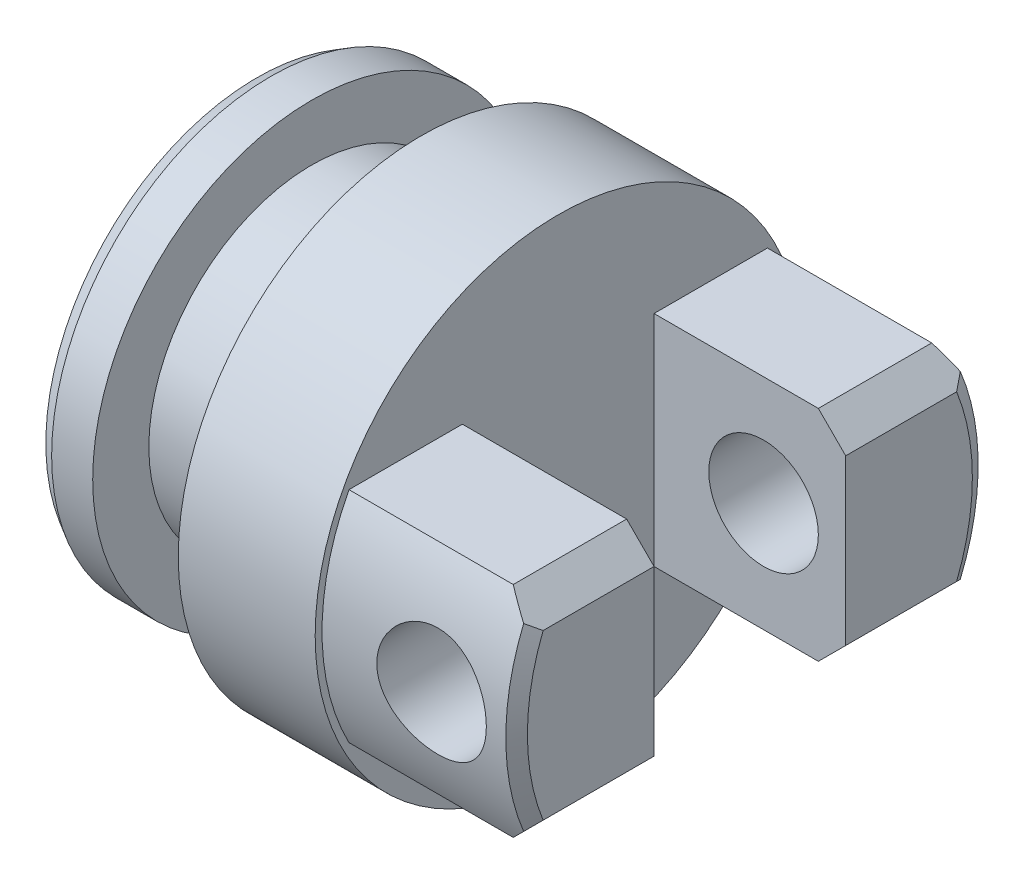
ISO-10303-21;
HEADER;
FILE_DESCRIPTION(('STEP AP214'),'2;1');
FILE_NAME('part.step','',(''),(''),'','','');
FILE_SCHEMA(('AUTOMOTIVE_DESIGN { 1 0 10303 214 1 1 1 1 }'));
ENDSEC;
DATA;
#1=APPLICATION_CONTEXT('core data for automotive mechanical design processes');
#2=APPLICATION_PROTOCOL_DEFINITION('international standard','automotive_design',2000,#1);
#3=PRODUCT_CONTEXT('',#1,'mechanical');
#4=PRODUCT('Part','Part','',(#3));
#5=PRODUCT_RELATED_PRODUCT_CATEGORY('part','',(#4));
#6=PRODUCT_DEFINITION_FORMATION('','',#4);
#7=PRODUCT_DEFINITION_CONTEXT('part definition',#1,'design');
#8=PRODUCT_DEFINITION('design','',#6,#7);
#9=PRODUCT_DEFINITION_SHAPE('','',#8);
#10=(LENGTH_UNIT() NAMED_UNIT(*) SI_UNIT(.MILLI.,.METRE.));
#11=(NAMED_UNIT(*) PLANE_ANGLE_UNIT() SI_UNIT($,.RADIAN.));
#12=(NAMED_UNIT(*) SI_UNIT($,.STERADIAN.) SOLID_ANGLE_UNIT());
#13=UNCERTAINTY_MEASURE_WITH_UNIT(LENGTH_MEASURE(1.E-05),#10,'distance_accuracy_value','');
#14=(GEOMETRIC_REPRESENTATION_CONTEXT(3) GLOBAL_UNCERTAINTY_ASSIGNED_CONTEXT((#13)) GLOBAL_UNIT_ASSIGNED_CONTEXT((#10,
#11,#12)) REPRESENTATION_CONTEXT('',''));
#15=CARTESIAN_POINT('',(0.,0.,0.));
#16=DIRECTION('',(0.,0.,1.));
#17=DIRECTION('',(1.,0.,0.));
#18=AXIS2_PLACEMENT_3D('',#15,#16,#17);
#19=CARTESIAN_POINT('',(0.,0.,0.));
#20=DIRECTION('',(-1.,0.,0.));
#21=DIRECTION('',(0.,0.,1.));
#22=AXIS2_PLACEMENT_3D('',#19,#20,#21);
#23=PLANE('',#22);
#24=DIRECTION('',(0.,-1.,0.));
#25=VECTOR('',#24,1.);
#26=CARTESIAN_POINT('',(0.,20.,7.));
#27=LINE('',#26,#25);
#28=CARTESIAN_POINT('',(0.,5.99999999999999,7.));
#29=VERTEX_POINT('',#28);
#30=CARTESIAN_POINT('',(0.,-5.99999999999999,7.));
#31=VERTEX_POINT('',#30);
#32=EDGE_CURVE('E319',#29,#31,#27,.T.);
#33=ORIENTED_EDGE('',*,*,#32,.F.);
#34=DIRECTION('',(0.,0.,1.));
#35=VECTOR('',#34,1.);
#36=CARTESIAN_POINT('',(0.,5.99999999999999,0.));
#37=LINE('',#36,#35);
#38=CARTESIAN_POINT('',(0.,5.99999999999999,15.101738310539));
#39=VERTEX_POINT('',#38);
#40=EDGE_CURVE('E191',#29,#39,#37,.T.);
#41=ORIENTED_EDGE('',*,*,#40,.T.);
#42=CARTESIAN_POINT('',(0.,0.,0.));
#43=DIRECTION('',(-1.,0.,0.));
#44=DIRECTION('',(0.,0.,1.));
#45=AXIS2_PLACEMENT_3D('',#42,#43,#44);
#46=CIRCLE('',#45,16.25);
#47=CARTESIAN_POINT('',(0.,-5.99999999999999,15.101738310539));
#48=VERTEX_POINT('',#47);
#49=EDGE_CURVE('E171',#39,#48,#46,.F.);
#50=ORIENTED_EDGE('',*,*,#49,.T.);
#51=DIRECTION('',(0.,0.,-1.));
#52=VECTOR('',#51,1.);
#53=CARTESIAN_POINT('',(0.,-5.99999999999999,0.));
#54=LINE('',#53,#52);
#55=EDGE_CURVE('E189',#48,#31,#54,.T.);
#56=ORIENTED_EDGE('',*,*,#55,.T.);
#57=EDGE_LOOP('',(#33,#41,#50,#56));
#58=FACE_BOUND('',#57,.T.);
#59=ADVANCED_FACE('F24',(#58),#23,.F.);
#60=CARTESIAN_POINT('',(-110.,0.,0.));
#61=DIRECTION('',(-1.,0.,0.));
#62=DIRECTION('',(0.,0.,1.));
#63=AXIS2_PLACEMENT_3D('',#60,#61,#62);
#64=CYLINDRICAL_SURFACE('',#63,17.25);
#65=CARTESIAN_POINT('',(-1.99999999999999,0.,17.25));
#66=CARTESIAN_POINT('',(-2.00000706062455,0.221506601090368,17.2499959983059));
#67=CARTESIAN_POINT('',(-2.01846148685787,0.44309577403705,17.2456904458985));
#68=CARTESIAN_POINT('',(-2.09170127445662,0.879956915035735,17.2289311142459));
#69=CARTESIAN_POINT('',(-2.14651041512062,1.0952246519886,17.2164720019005));
#70=CARTESIAN_POINT('',(-2.29063244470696,1.51306826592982,17.1847897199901));
#71=CARTESIAN_POINT('',(-2.37990708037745,1.71565792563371,17.1655740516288));
#72=CARTESIAN_POINT('',(-2.59029904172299,2.10298031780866,17.1224413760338));
#73=CARTESIAN_POINT('',(-2.71141632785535,2.28771307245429,17.0985243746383));
#74=CARTESIAN_POINT('',(-2.98434860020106,2.63738921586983,17.0481208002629));
#75=CARTESIAN_POINT('',(-3.13662529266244,2.80196719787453,17.0215991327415));
#76=CARTESIAN_POINT('',(-3.46656368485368,3.1034905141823,16.9692168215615));
#77=CARTESIAN_POINT('',(-3.64422787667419,3.24043313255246,16.9433562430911));
#78=CARTESIAN_POINT('',(-4.02265469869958,3.48445355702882,16.8948751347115));
#79=CARTESIAN_POINT('',(-4.22367958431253,3.59113436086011,16.8722994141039));
#80=CARTESIAN_POINT('',(-4.64141512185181,3.76905373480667,16.8334513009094));
#81=CARTESIAN_POINT('',(-4.85812364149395,3.84029711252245,16.817178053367));
#82=CARTESIAN_POINT('',(-5.2970883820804,3.94409580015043,16.7931362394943));
#83=CARTESIAN_POINT('',(-5.5191826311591,3.97730224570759,16.7852247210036));
#84=CARTESIAN_POINT('',(-5.96591974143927,4.00611058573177,16.7783734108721));
#85=CARTESIAN_POINT('',(-6.19056224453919,4.00171770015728,16.7794323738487));
#86=CARTESIAN_POINT('',(-6.63111872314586,3.95597424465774,16.790273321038));
#87=CARTESIAN_POINT('',(-6.84711716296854,3.91538784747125,16.7998749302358));
#88=CARTESIAN_POINT('',(-7.26915302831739,3.79962352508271,16.8264332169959));
#89=CARTESIAN_POINT('',(-7.47518983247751,3.72444344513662,16.8433903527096));
#90=CARTESIAN_POINT('',(-7.87356168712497,3.54094485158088,16.8829218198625));
#91=CARTESIAN_POINT('',(-8.0657594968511,3.43233923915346,16.9055444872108));
#92=CARTESIAN_POINT('',(-8.4294820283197,3.18527389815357,16.9538293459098));
#93=CARTESIAN_POINT('',(-8.6010035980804,3.04680962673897,16.979491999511));
#94=CARTESIAN_POINT('',(-8.92289638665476,2.73994743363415,17.0317334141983));
#95=CARTESIAN_POINT('',(-9.07264952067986,2.57090164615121,17.0583192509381));
#96=CARTESIAN_POINT('',(-9.34178879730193,2.20978670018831,17.108843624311));
#97=CARTESIAN_POINT('',(-9.46117424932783,2.01771701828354,17.1327821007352));
#98=CARTESIAN_POINT('',(-9.66637164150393,1.61520052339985,17.1754080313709));
#99=CARTESIAN_POINT('',(-9.75209475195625,1.40470685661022,17.1940815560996));
#100=CARTESIAN_POINT('',(-9.8867764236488,0.971771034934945,17.2239711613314));
#101=CARTESIAN_POINT('',(-9.93574101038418,0.749330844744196,17.2351884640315));
#102=CARTESIAN_POINT('',(-9.99459855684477,0.304110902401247,17.2487249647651));
#103=CARTESIAN_POINT('',(-10.0053347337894,0.0814483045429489,17.2512361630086));
#104=CARTESIAN_POINT('',(-9.9897272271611,-0.362489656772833,17.2476191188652));
#105=CARTESIAN_POINT('',(-9.9633863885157,-0.583765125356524,17.2414915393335));
#106=CARTESIAN_POINT('',(-9.87507032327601,-1.01579848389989,17.221407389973));
#107=CARTESIAN_POINT('',(-9.81354457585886,-1.22665326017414,17.2075496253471));
#108=CARTESIAN_POINT('',(-9.65710994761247,-1.6350457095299,17.1735597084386));
#109=CARTESIAN_POINT('',(-9.56219799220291,-1.83258215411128,17.1534269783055));
#110=CARTESIAN_POINT('',(-9.33997837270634,-2.21216422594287,17.1086517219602));
#111=CARTESIAN_POINT('',(-9.21218467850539,-2.39391735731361,17.0839432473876));
#112=CARTESIAN_POINT('',(-8.92846140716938,-2.73370057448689,17.0328786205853));
#113=CARTESIAN_POINT('',(-8.77252769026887,-2.89172716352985,17.0065222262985));
#114=CARTESIAN_POINT('',(-8.43306118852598,-3.18296339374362,16.9544575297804));
#115=CARTESIAN_POINT('',(-8.24902001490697,-3.31558580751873,16.9287742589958));
#116=CARTESIAN_POINT('',(-7.86078631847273,-3.54804966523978,16.8815866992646));
#117=CARTESIAN_POINT('',(-7.65659469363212,-3.64789256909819,16.860082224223));
#118=CARTESIAN_POINT('',(-7.23497071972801,-3.8112529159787,16.8239072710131));
#119=CARTESIAN_POINT('',(-7.01762394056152,-3.87498197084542,16.809197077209));
#120=CARTESIAN_POINT('',(-6.57491612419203,-3.96490426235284,16.788216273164));
#121=CARTESIAN_POINT('',(-6.34955656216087,-3.99110437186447,16.7819441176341));
#122=CARTESIAN_POINT('',(-5.90316218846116,-4.00490486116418,16.7786553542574));
#123=CARTESIAN_POINT('',(-5.68215739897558,-3.99343911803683,16.7814148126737));
#124=CARTESIAN_POINT('',(-5.24532276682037,-3.93434122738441,16.7953673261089));
#125=CARTESIAN_POINT('',(-5.02949284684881,-3.88670962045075,16.8065602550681));
#126=CARTESIAN_POINT('',(-4.60998733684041,-3.75710794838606,16.8360028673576));
#127=CARTESIAN_POINT('',(-4.40626248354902,-3.67528976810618,16.8542213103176));
#128=CARTESIAN_POINT('',(-4.01529825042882,-3.47976246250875,16.8956709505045));
#129=CARTESIAN_POINT('',(-3.82806083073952,-3.36604955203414,16.9189027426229));
#130=CARTESIAN_POINT('',(-3.47081908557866,-3.1069323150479,16.9684180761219));
#131=CARTESIAN_POINT('',(-3.30130026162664,-2.96086942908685,16.9947587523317));
#132=CARTESIAN_POINT('',(-2.98887408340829,-2.64251267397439,17.0471581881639));
#133=CARTESIAN_POINT('',(-2.84597294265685,-2.47021269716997,17.0732168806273));
#134=CARTESIAN_POINT('',(-2.58877209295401,-2.10115892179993,17.122580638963));
#135=CARTESIAN_POINT('',(-2.47493294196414,-1.90407744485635,17.1458386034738));
#136=CARTESIAN_POINT('',(-2.28218053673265,-1.49306767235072,17.1864989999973));
#137=CARTESIAN_POINT('',(-2.20323969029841,-1.27915284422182,17.2039060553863));
#138=CARTESIAN_POINT('',(-2.0956527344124,-0.88770869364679,17.2280104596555));
#139=CARTESIAN_POINT('',(-2.05985497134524,-0.712201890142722,17.236203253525));
#140=CARTESIAN_POINT('',(-2.01202641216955,-0.357814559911,17.2471994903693));
#141=CARTESIAN_POINT('',(-1.99999429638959,-0.178934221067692,17.25000323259));
#142=CARTESIAN_POINT('',(-1.99999999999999,0.,17.25));
#143=B_SPLINE_CURVE_WITH_KNOTS('',3,(#65,#66,#67,#68,#69,#70,#71,#72,#73,#74,#75,#76,#77,#78,
#79,#80,#81,#82,#83,#84,#85,#86,#87,#88,#89,#90,#91,#92,#93,#94,#95,#96,#97,#98,#99,#100,#101,
#102,#103,#104,#105,#106,#107,#108,#109,#110,#111,#112,#113,#114,#115,#116,#117,#118,#119,#120,
#121,#122,#123,#124,#125,#126,#127,#128,#129,#130,#131,#132,#133,#134,#135,#136,#137,#138,#139,
#140,#141,#142),.UNSPECIFIED.,.T.,.F.,(4,2,2,2,2,2,2,2,2,2,2,2,2,2,2,2,2,2,2,2,2,2,2,2,2,2,2,2,
2,2,2,2,2,2,2,2,2,2,4),(0.,0.663864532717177,1.3281637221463,1.99172771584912,2.65529088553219,
3.32950939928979,4.00379414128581,4.68655391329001,5.36922103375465,6.04001855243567,
6.71072294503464,7.36759312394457,8.02450422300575,8.68722303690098,9.35004275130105,
10.0290330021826,10.7080386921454,11.3888243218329,12.0694983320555,12.7350621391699,
13.4005748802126,14.0577699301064,14.7150255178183,15.3826181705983,16.0503091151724,
16.7319447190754,17.4135499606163,18.0911188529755,18.768563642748,19.4293400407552,
20.090106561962,20.7479681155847,21.4059077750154,22.0787271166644,22.7517033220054,
23.4347615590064,24.1172787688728,24.6535818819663,25.1898552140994),.UNSPECIFIED.);
#144=CARTESIAN_POINT('',(-1.99999999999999,0.,17.25));
#145=VERTEX_POINT('',#144);
#146=EDGE_CURVE('E346',#145,#145,#143,.T.);
#147=ORIENTED_EDGE('',*,*,#146,.F.);
#148=EDGE_LOOP('',(#147));
#149=FACE_BOUND('',#148,.T.);
#150=CARTESIAN_POINT('',(-0.577350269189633,0.,0.));
#151=DIRECTION('',(-1.,0.,0.));
#152=DIRECTION('',(0.,0.,1.));
#153=AXIS2_PLACEMENT_3D('',#150,#151,#152);
#154=CIRCLE('',#153,17.25);
#155=CARTESIAN_POINT('',(-0.577350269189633,-6.57735026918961,15.9468167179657));
#156=VERTEX_POINT('',#155);
#157=CARTESIAN_POINT('',(-0.577350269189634,6.57735026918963,15.9468167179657));
#158=VERTEX_POINT('',#157);
#159=EDGE_CURVE('E168',#156,#158,#154,.T.);
#160=ORIENTED_EDGE('',*,*,#159,.T.);
#161=CARTESIAN_POINT('',(6.00000000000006,0.,0.));
#162=DIRECTION('',(-0.707106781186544,-0.707106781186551,0.));
#163=DIRECTION('',(-0.707106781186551,0.707106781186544,0.));
#164=AXIS2_PLACEMENT_3D('',#161,#162,#163);
#165=ELLIPSE('',#164,24.395183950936,17.25);
#166=CARTESIAN_POINT('',(-2.00000000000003,8.,15.2827517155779));
#167=VERTEX_POINT('',#166);
#168=EDGE_CURVE('E536',#158,#167,#165,.T.);
#169=ORIENTED_EDGE('',*,*,#168,.T.);
#170=DIRECTION('',(-1.,0.,0.));
#171=VECTOR('',#170,1.);
#172=CARTESIAN_POINT('',(-110.,8.,15.2827517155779));
#173=LINE('',#172,#171);
#174=CARTESIAN_POINT('',(-14.,8.,15.2827517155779));
#175=VERTEX_POINT('',#174);
#176=EDGE_CURVE('E316',#175,#167,#173,.F.);
#177=ORIENTED_EDGE('',*,*,#176,.F.);
#178=CARTESIAN_POINT('',(-14.,0.,0.));
#179=DIRECTION('',(-1.,0.,0.));
#180=DIRECTION('',(0.,0.,1.));
#181=AXIS2_PLACEMENT_3D('',#178,#179,#180);
#182=CIRCLE('',#181,17.25);
#183=CARTESIAN_POINT('',(-14.,-8.,15.2827517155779));
#184=VERTEX_POINT('',#183);
#185=EDGE_CURVE('E157',#184,#175,#182,.T.);
#186=ORIENTED_EDGE('',*,*,#185,.F.);
#187=DIRECTION('',(-1.,0.,0.));
#188=VECTOR('',#187,1.);
#189=CARTESIAN_POINT('',(-110.,-8.,15.2827517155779));
#190=LINE('',#189,#188);
#191=CARTESIAN_POINT('',(-2.00000000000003,-8.,15.2827517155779));
#192=VERTEX_POINT('',#191);
#193=EDGE_CURVE('E149',#192,#184,#190,.T.);
#194=ORIENTED_EDGE('',*,*,#193,.F.);
#195=CARTESIAN_POINT('',(6.00000000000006,0.,0.));
#196=DIRECTION('',(-0.707106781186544,0.707106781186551,0.));
#197=DIRECTION('',(-0.707106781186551,-0.707106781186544,0.));
#198=AXIS2_PLACEMENT_3D('',#195,#196,#197);
#199=ELLIPSE('',#198,24.395183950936,17.25);
#200=EDGE_CURVE('E329',#192,#156,#199,.T.);
#201=ORIENTED_EDGE('',*,*,#200,.T.);
#202=EDGE_LOOP('',(#160,#169,#177,#186,#194,#201));
#203=FACE_BOUND('',#202,.T.);
#204=ADVANCED_FACE('F281',(#149,#203),#64,.T.);
#205=CARTESIAN_POINT('',(-0.577350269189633,0.,0.));
#206=DIRECTION('',(-1.,0.,0.));
#207=DIRECTION('',(0.,0.,1.));
#208=AXIS2_PLACEMENT_3D('',#205,#206,#207);
#209=CONICAL_SURFACE('',#208,17.25,1.04719755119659);
#210=ORIENTED_EDGE('',*,*,#49,.F.);
#211=CARTESIAN_POINT('',(0.,5.99999999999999,15.101738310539));
#212=CARTESIAN_POINT('',(-0.0961349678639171,6.0961349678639,15.2427077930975));
#213=CARTESIAN_POINT('',(-0.192314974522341,6.19231497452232,15.3836157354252));
#214=CARTESIAN_POINT('',(-0.384765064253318,6.3847650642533,15.6653085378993));
#215=CARTESIAN_POINT('',(-0.481035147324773,6.48103514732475,15.8060933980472));
#216=CARTESIAN_POINT('',(-0.577350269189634,6.57735026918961,15.9468167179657));
#217=B_SPLINE_CURVE_WITH_KNOTS('',3,(#211,#212,#213,#214,#215,#216),.UNSPECIFIED.,.F.,.F.,(4,2,
4),(0.,0.587542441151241,1.17508487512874),.UNSPECIFIED.);
#218=EDGE_CURVE('E200',#39,#158,#217,.T.);
#219=ORIENTED_EDGE('',*,*,#218,.T.);
#220=ORIENTED_EDGE('',*,*,#159,.F.);
#221=CARTESIAN_POINT('',(-0.577350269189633,-6.57735026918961,15.9468167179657));
#222=CARTESIAN_POINT('',(-0.481035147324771,-6.48103514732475,15.8060933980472));
#223=CARTESIAN_POINT('',(-0.384765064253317,-6.3847650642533,15.6653085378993));
#224=CARTESIAN_POINT('',(-0.192314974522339,-6.19231497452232,15.3836157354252));
#225=CARTESIAN_POINT('',(-0.0961349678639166,-6.0961349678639,15.2427077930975));
#226=CARTESIAN_POINT('',(0.,-5.99999999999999,15.101738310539));
#227=B_SPLINE_CURVE_WITH_KNOTS('',3,(#221,#222,#223,#224,#225,#226),.UNSPECIFIED.,.F.,.F.,(4,2,
4),(0.,0.587542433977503,1.17508487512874),.UNSPECIFIED.);
#228=EDGE_CURVE('E193',#156,#48,#227,.T.);
#229=ORIENTED_EDGE('',*,*,#228,.T.);
#230=EDGE_LOOP('',(#210,#219,#220,#229));
#231=FACE_BOUND('',#230,.T.);
#232=ADVANCED_FACE('F288',(#231),#209,.T.);
#233=CARTESIAN_POINT('',(0.,-5.99999999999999,-15.101738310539));
#234=VERTEX_POINT('',#233);
#235=CARTESIAN_POINT('',(0.,5.99999999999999,-15.101738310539));
#236=VERTEX_POINT('',#235);
#237=EDGE_CURVE('E172',#234,#236,#46,.F.);
#238=ORIENTED_EDGE('',*,*,#237,.T.);
#239=DIRECTION('',(0.,0.,1.));
#240=VECTOR('',#239,1.);
#241=CARTESIAN_POINT('',(0.,5.99999999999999,0.));
#242=LINE('',#241,#240);
#243=CARTESIAN_POINT('',(0.,5.99999999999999,-7.));
#244=VERTEX_POINT('',#243);
#245=EDGE_CURVE('E47',#236,#244,#242,.T.);
#246=ORIENTED_EDGE('',*,*,#245,.T.);
#247=DIRECTION('',(0.,1.,0.));
#248=VECTOR('',#247,1.);
#249=CARTESIAN_POINT('',(0.,-20.,-7.));
#250=LINE('',#249,#248);
#251=CARTESIAN_POINT('',(0.,-5.99999999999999,-7.));
#252=VERTEX_POINT('',#251);
#253=EDGE_CURVE('E254',#252,#244,#250,.T.);
#254=ORIENTED_EDGE('',*,*,#253,.F.);
#255=DIRECTION('',(0.,0.,-1.));
#256=VECTOR('',#255,1.);
#257=CARTESIAN_POINT('',(0.,-5.99999999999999,0.));
#258=LINE('',#257,#256);
#259=EDGE_CURVE('E238',#252,#234,#258,.T.);
#260=ORIENTED_EDGE('',*,*,#259,.T.);
#261=EDGE_LOOP('',(#238,#246,#254,#260));
#262=FACE_BOUND('',#261,.T.);
#263=ADVANCED_FACE('F26',(#262),#23,.F.);
#264=CARTESIAN_POINT('',(-2.,0.,-17.25));
#265=CARTESIAN_POINT('',(-2.00000706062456,-0.221506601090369,-17.2499959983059));
#266=CARTESIAN_POINT('',(-2.01846148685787,-0.44309577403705,-17.2456904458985));
#267=CARTESIAN_POINT('',(-2.09170127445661,-0.879956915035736,-17.2289311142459));
#268=CARTESIAN_POINT('',(-2.14651041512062,-1.0952246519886,-17.2164720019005));
#269=CARTESIAN_POINT('',(-2.29063244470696,-1.51306826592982,-17.1847897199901));
#270=CARTESIAN_POINT('',(-2.37990708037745,-1.71565792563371,-17.1655740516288));
#271=CARTESIAN_POINT('',(-2.59029904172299,-2.10298031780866,-17.1224413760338));
#272=CARTESIAN_POINT('',(-2.71141632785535,-2.28771307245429,-17.0985243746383));
#273=CARTESIAN_POINT('',(-2.98434860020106,-2.63738921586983,-17.0481208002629));
#274=CARTESIAN_POINT('',(-3.13662529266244,-2.80196719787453,-17.0215991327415));
#275=CARTESIAN_POINT('',(-3.46656368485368,-3.1034905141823,-16.9692168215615));
#276=CARTESIAN_POINT('',(-3.64422787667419,-3.24043313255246,-16.9433562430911));
#277=CARTESIAN_POINT('',(-4.02265469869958,-3.48445355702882,-16.8948751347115));
#278=CARTESIAN_POINT('',(-4.22367958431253,-3.59113436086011,-16.8722994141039));
#279=CARTESIAN_POINT('',(-4.64141512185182,-3.76905373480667,-16.8334513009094));
#280=CARTESIAN_POINT('',(-4.85812364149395,-3.84029711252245,-16.817178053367));
#281=CARTESIAN_POINT('',(-5.2970883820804,-3.94409580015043,-16.7931362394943));
#282=CARTESIAN_POINT('',(-5.5191826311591,-3.97730224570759,-16.7852247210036));
#283=CARTESIAN_POINT('',(-5.96591974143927,-4.00611058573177,-16.7783734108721));
#284=CARTESIAN_POINT('',(-6.19056224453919,-4.00171770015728,-16.7794323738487));
#285=CARTESIAN_POINT('',(-6.63111872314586,-3.95597424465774,-16.790273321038));
#286=CARTESIAN_POINT('',(-6.84711716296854,-3.91538784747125,-16.7998749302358));
#287=CARTESIAN_POINT('',(-7.26915302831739,-3.79962352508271,-16.8264332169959));
#288=CARTESIAN_POINT('',(-7.47518983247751,-3.72444344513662,-16.8433903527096));
#289=CARTESIAN_POINT('',(-7.87356168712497,-3.54094485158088,-16.8829218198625));
#290=CARTESIAN_POINT('',(-8.0657594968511,-3.43233923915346,-16.9055444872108));
#291=CARTESIAN_POINT('',(-8.4294820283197,-3.18527389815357,-16.9538293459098));
#292=CARTESIAN_POINT('',(-8.6010035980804,-3.04680962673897,-16.979491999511));
#293=CARTESIAN_POINT('',(-8.92289638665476,-2.73994743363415,-17.0317334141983));
#294=CARTESIAN_POINT('',(-9.07264952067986,-2.57090164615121,-17.0583192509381));
#295=CARTESIAN_POINT('',(-9.34178879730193,-2.20978670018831,-17.108843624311));
#296=CARTESIAN_POINT('',(-9.46117424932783,-2.01771701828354,-17.1327821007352));
#297=CARTESIAN_POINT('',(-9.66637164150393,-1.61520052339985,-17.1754080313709));
#298=CARTESIAN_POINT('',(-9.75209475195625,-1.40470685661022,-17.1940815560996));
#299=CARTESIAN_POINT('',(-9.88677642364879,-0.971771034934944,-17.2239711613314));
#300=CARTESIAN_POINT('',(-9.93574101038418,-0.749330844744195,-17.2351884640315));
#301=CARTESIAN_POINT('',(-9.99459855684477,-0.304110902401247,-17.2487249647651));
#302=CARTESIAN_POINT('',(-10.0053347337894,-0.0814483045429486,-17.2512361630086));
#303=CARTESIAN_POINT('',(-9.9897272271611,0.362489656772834,-17.2476191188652));
#304=CARTESIAN_POINT('',(-9.9633863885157,0.583765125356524,-17.2414915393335));
#305=CARTESIAN_POINT('',(-9.87507032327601,1.01579848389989,-17.221407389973));
#306=CARTESIAN_POINT('',(-9.81354457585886,1.22665326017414,-17.2075496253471));
#307=CARTESIAN_POINT('',(-9.65710994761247,1.6350457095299,-17.1735597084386));
#308=CARTESIAN_POINT('',(-9.56219799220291,1.83258215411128,-17.1534269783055));
#309=CARTESIAN_POINT('',(-9.33997837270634,2.21216422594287,-17.1086517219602));
#310=CARTESIAN_POINT('',(-9.21218467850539,2.39391735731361,-17.0839432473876));
#311=CARTESIAN_POINT('',(-8.92846140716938,2.73370057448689,-17.0328786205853));
#312=CARTESIAN_POINT('',(-8.77252769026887,2.89172716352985,-17.0065222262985));
#313=CARTESIAN_POINT('',(-8.43306118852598,3.18296339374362,-16.9544575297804));
#314=CARTESIAN_POINT('',(-8.24902001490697,3.31558580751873,-16.9287742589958));
#315=CARTESIAN_POINT('',(-7.86078631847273,3.54804966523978,-16.8815866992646));
#316=CARTESIAN_POINT('',(-7.65659469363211,3.64789256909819,-16.860082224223));
#317=CARTESIAN_POINT('',(-7.23497071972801,3.8112529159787,-16.8239072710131));
#318=CARTESIAN_POINT('',(-7.01762394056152,3.87498197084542,-16.809197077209));
#319=CARTESIAN_POINT('',(-6.57491612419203,3.96490426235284,-16.788216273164));
#320=CARTESIAN_POINT('',(-6.34955656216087,3.99110437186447,-16.7819441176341));
#321=CARTESIAN_POINT('',(-5.90316218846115,4.00490486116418,-16.7786553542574));
#322=CARTESIAN_POINT('',(-5.68215739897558,3.99343911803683,-16.7814148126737));
#323=CARTESIAN_POINT('',(-5.24532276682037,3.93434122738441,-16.7953673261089));
#324=CARTESIAN_POINT('',(-5.02949284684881,3.88670962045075,-16.8065602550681));
#325=CARTESIAN_POINT('',(-4.60998733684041,3.75710794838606,-16.8360028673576));
#326=CARTESIAN_POINT('',(-4.40626248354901,3.67528976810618,-16.8542213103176));
#327=CARTESIAN_POINT('',(-4.01529825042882,3.47976246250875,-16.8956709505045));
#328=CARTESIAN_POINT('',(-3.82806083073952,3.36604955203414,-16.9189027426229));
#329=CARTESIAN_POINT('',(-3.47081908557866,3.1069323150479,-16.9684180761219));
#330=CARTESIAN_POINT('',(-3.30130026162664,2.96086942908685,-16.9947587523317));
#331=CARTESIAN_POINT('',(-2.98887408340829,2.64251267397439,-17.0471581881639));
#332=CARTESIAN_POINT('',(-2.84597294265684,2.47021269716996,-17.0732168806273));
#333=CARTESIAN_POINT('',(-2.58877209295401,2.10115892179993,-17.122580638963));
#334=CARTESIAN_POINT('',(-2.47493294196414,1.90407744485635,-17.1458386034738));
#335=CARTESIAN_POINT('',(-2.28218053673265,1.49306767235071,-17.1864989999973));
#336=CARTESIAN_POINT('',(-2.20323969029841,1.27915284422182,-17.2039060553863));
#337=CARTESIAN_POINT('',(-2.0956527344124,0.887708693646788,-17.2280104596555));
#338=CARTESIAN_POINT('',(-2.05985497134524,0.712201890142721,-17.236203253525));
#339=CARTESIAN_POINT('',(-2.01202641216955,0.357814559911,-17.2471994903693));
#340=CARTESIAN_POINT('',(-1.99999429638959,0.178934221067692,-17.25000323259));
#341=CARTESIAN_POINT('',(-2.,0.,-17.25));
#342=B_SPLINE_CURVE_WITH_KNOTS('',3,(#264,#265,#266,#267,#268,#269,#270,#271,#272,#273,#274,
#275,#276,#277,#278,#279,#280,#281,#282,#283,#284,#285,#286,#287,#288,#289,#290,#291,#292,#293,
#294,#295,#296,#297,#298,#299,#300,#301,#302,#303,#304,#305,#306,#307,#308,#309,#310,#311,#312,
#313,#314,#315,#316,#317,#318,#319,#320,#321,#322,#323,#324,#325,#326,#327,#328,#329,#330,#331,
#332,#333,#334,#335,#336,#337,#338,#339,#340,#341),.UNSPECIFIED.,.T.,.F.,(4,2,2,2,2,2,2,2,2,2,2,
2,2,2,2,2,2,2,2,2,2,2,2,2,2,2,2,2,2,2,2,2,2,2,2,2,2,2,4),(0.,0.663864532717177,1.3281637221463,
1.99172771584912,2.65529088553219,3.32950939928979,4.00379414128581,4.68655391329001,
5.36922103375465,6.04001855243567,6.71072294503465,7.36759312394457,8.02450422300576,
8.68722303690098,9.35004275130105,10.0290330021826,10.7080386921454,11.3888243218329,
12.0694983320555,12.7350621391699,13.4005748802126,14.0577699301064,14.7150255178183,
15.3826181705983,16.0503091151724,16.7319447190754,17.4135499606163,18.0911188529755,
18.768563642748,19.4293400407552,20.090106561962,20.7479681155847,21.4059077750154,
22.0787271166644,22.7517033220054,23.4347615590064,24.1172787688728,24.6535818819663,
25.1898552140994),.UNSPECIFIED.);
#343=CARTESIAN_POINT('',(-2.,0.,-17.25));
#344=VERTEX_POINT('',#343);
#345=EDGE_CURVE('E348',#344,#344,#342,.T.);
#346=ORIENTED_EDGE('',*,*,#345,.F.);
#347=EDGE_LOOP('',(#346));
#348=FACE_BOUND('',#347,.T.);
#349=DIRECTION('',(-1.,0.,0.));
#350=VECTOR('',#349,1.);
#351=CARTESIAN_POINT('',(-110.,8.,-15.2827517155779));
#352=LINE('',#351,#350);
#353=CARTESIAN_POINT('',(-2.00000000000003,8.,-15.2827517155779));
#354=VERTEX_POINT('',#353);
#355=CARTESIAN_POINT('',(-14.,8.,-15.2827517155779));
#356=VERTEX_POINT('',#355);
#357=EDGE_CURVE('E307',#354,#356,#352,.T.);
#358=ORIENTED_EDGE('',*,*,#357,.F.);
#359=CARTESIAN_POINT('',(6.00000000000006,0.,0.));
#360=DIRECTION('',(-0.707106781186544,-0.707106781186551,0.));
#361=DIRECTION('',(-0.707106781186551,0.707106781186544,0.));
#362=AXIS2_PLACEMENT_3D('',#359,#360,#361);
#363=ELLIPSE('',#362,24.395183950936,17.25);
#364=CARTESIAN_POINT('',(-0.577350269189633,6.57735026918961,-15.9468167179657));
#365=VERTEX_POINT('',#364);
#366=EDGE_CURVE('E232',#354,#365,#363,.T.);
#367=ORIENTED_EDGE('',*,*,#366,.T.);
#368=CARTESIAN_POINT('',(-0.577350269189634,-6.57735026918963,-15.9468167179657));
#369=VERTEX_POINT('',#368);
#370=EDGE_CURVE('E169',#365,#369,#154,.T.);
#371=ORIENTED_EDGE('',*,*,#370,.T.);
#372=CARTESIAN_POINT('',(6.00000000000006,0.,0.));
#373=DIRECTION('',(-0.707106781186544,0.707106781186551,0.));
#374=DIRECTION('',(-0.707106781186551,-0.707106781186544,0.));
#375=AXIS2_PLACEMENT_3D('',#372,#373,#374);
#376=ELLIPSE('',#375,24.395183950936,17.25);
#377=CARTESIAN_POINT('',(-2.00000000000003,-8.,-15.2827517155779));
#378=VERTEX_POINT('',#377);
#379=EDGE_CURVE('E148',#369,#378,#376,.T.);
#380=ORIENTED_EDGE('',*,*,#379,.T.);
#381=DIRECTION('',(-1.,0.,0.));
#382=VECTOR('',#381,1.);
#383=CARTESIAN_POINT('',(-110.,-8.,-15.2827517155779));
#384=LINE('',#383,#382);
#385=CARTESIAN_POINT('',(-14.,-8.,-15.2827517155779));
#386=VERTEX_POINT('',#385);
#387=EDGE_CURVE('E131',#386,#378,#384,.F.);
#388=ORIENTED_EDGE('',*,*,#387,.F.);
#389=EDGE_CURVE('E145',#356,#386,#182,.T.);
#390=ORIENTED_EDGE('',*,*,#389,.F.);
#391=EDGE_LOOP('',(#358,#367,#371,#380,#388,#390));
#392=FACE_BOUND('',#391,.T.);
#393=ADVANCED_FACE('F144',(#348,#392),#64,.T.);
#394=CARTESIAN_POINT('',(-14.,17.75,0.));
#395=DIRECTION('',(1.,0.,0.));
#396=DIRECTION('',(0.,0.,-1.));
#397=AXIS2_PLACEMENT_3D('',#394,#395,#396);
#398=PLANE('',#397);
#399=DIRECTION('',(0.,0.,1.));
#400=VECTOR('',#399,1.);
#401=CARTESIAN_POINT('',(-14.,-8.,-20.));
#402=LINE('',#401,#400);
#403=CARTESIAN_POINT('',(-14.,-8.,7.));
#404=VERTEX_POINT('',#403);
#405=EDGE_CURVE('E139',#404,#184,#402,.T.);
#406=ORIENTED_EDGE('',*,*,#405,.T.);
#407=ORIENTED_EDGE('',*,*,#185,.T.);
#408=DIRECTION('',(0.,0.,-1.));
#409=VECTOR('',#408,1.);
#410=CARTESIAN_POINT('',(-14.,8.,30.));
#411=LINE('',#410,#409);
#412=CARTESIAN_POINT('',(-14.,8.,7.));
#413=VERTEX_POINT('',#412);
#414=EDGE_CURVE('E308',#175,#413,#411,.T.);
#415=ORIENTED_EDGE('',*,*,#414,.T.);
#416=DIRECTION('',(0.,-1.,0.));
#417=VECTOR('',#416,1.);
#418=CARTESIAN_POINT('',(-14.,20.,7.));
#419=LINE('',#418,#417);
#420=EDGE_CURVE('E248',#413,#404,#419,.T.);
#421=ORIENTED_EDGE('',*,*,#420,.T.);
#422=EDGE_LOOP('',(#406,#407,#415,#421));
#423=FACE_BOUND('',#422,.T.);
#424=ORIENTED_EDGE('',*,*,#389,.T.);
#425=CARTESIAN_POINT('',(-14.,-8.,-7.));
#426=VERTEX_POINT('',#425);
#427=EDGE_CURVE('E128',#386,#426,#402,.T.);
#428=ORIENTED_EDGE('',*,*,#427,.T.);
#429=DIRECTION('',(0.,1.,0.));
#430=VECTOR('',#429,1.);
#431=CARTESIAN_POINT('',(-14.,-20.,-7.));
#432=LINE('',#431,#430);
#433=CARTESIAN_POINT('',(-14.,8.,-7.00000000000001));
#434=VERTEX_POINT('',#433);
#435=EDGE_CURVE('E245',#426,#434,#432,.T.);
#436=ORIENTED_EDGE('',*,*,#435,.T.);
#437=EDGE_CURVE('E155',#434,#356,#411,.T.);
#438=ORIENTED_EDGE('',*,*,#437,.T.);
#439=EDGE_LOOP('',(#424,#428,#436,#438));
#440=FACE_BOUND('',#439,.T.);
#441=CARTESIAN_POINT('',(-14.,0.,0.));
#442=DIRECTION('',(-1.,0.,0.));
#443=DIRECTION('',(0.,0.,1.));
#444=AXIS2_PLACEMENT_3D('',#441,#442,#443);
#445=CIRCLE('',#444,17.75);
#446=CARTESIAN_POINT('',(-14.,0.,17.75));
#447=VERTEX_POINT('',#446);
#448=EDGE_CURVE('E162',#447,#447,#445,.T.);
#449=ORIENTED_EDGE('',*,*,#448,.F.);
#450=EDGE_LOOP('',(#449));
#451=FACE_BOUND('',#450,.T.);
#452=ADVANCED_FACE('F152',(#423,#440,#451),#398,.T.);
#453=CARTESIAN_POINT('',(-110.,0.,0.));
#454=DIRECTION('',(-1.,0.,0.));
#455=DIRECTION('',(0.,0.,1.));
#456=AXIS2_PLACEMENT_3D('',#453,#454,#455);
#457=CYLINDRICAL_SURFACE('',#456,17.75);
#458=CARTESIAN_POINT('',(-24.,0.,0.));
#459=DIRECTION('',(-1.,0.,0.));
#460=DIRECTION('',(0.,0.,1.));
#461=AXIS2_PLACEMENT_3D('',#458,#459,#460);
#462=CIRCLE('',#461,17.75);
#463=CARTESIAN_POINT('',(-24.,0.,17.75));
#464=VERTEX_POINT('',#463);
#465=EDGE_CURVE('E262',#464,#464,#462,.T.);
#466=ORIENTED_EDGE('',*,*,#465,.F.);
#467=EDGE_LOOP('',(#466));
#468=FACE_BOUND('',#467,.T.);
#469=ORIENTED_EDGE('',*,*,#448,.T.);
#470=EDGE_LOOP('',(#469));
#471=FACE_BOUND('',#470,.T.);
#472=ADVANCED_FACE('F269',(#468,#471),#457,.T.);
#473=CARTESIAN_POINT('',(-24.,17.75,0.));
#474=DIRECTION('',(1.,0.,0.));
#475=DIRECTION('',(0.,0.,-1.));
#476=AXIS2_PLACEMENT_3D('',#473,#474,#475);
#477=PLANE('',#476);
#478=CARTESIAN_POINT('',(-24.,0.,0.));
#479=DIRECTION('',(-1.,0.,0.));
#480=DIRECTION('',(0.,0.,1.));
#481=AXIS2_PLACEMENT_3D('',#478,#479,#480);
#482=CIRCLE('',#481,11.9);
#483=CARTESIAN_POINT('',(-24.,0.,11.9));
#484=VERTEX_POINT('',#483);
#485=EDGE_CURVE('E260',#484,#484,#482,.T.);
#486=ORIENTED_EDGE('',*,*,#485,.F.);
#487=EDGE_LOOP('',(#486));
#488=FACE_BOUND('',#487,.T.);
#489=ORIENTED_EDGE('',*,*,#465,.T.);
#490=EDGE_LOOP('',(#489));
#491=FACE_BOUND('',#490,.T.);
#492=ADVANCED_FACE('F277',(#488,#491),#477,.F.);
#493=CARTESIAN_POINT('',(-110.,0.,0.));
#494=DIRECTION('',(-1.,0.,0.));
#495=DIRECTION('',(0.,0.,1.));
#496=AXIS2_PLACEMENT_3D('',#493,#494,#495);
#497=CYLINDRICAL_SURFACE('',#496,11.9);
#498=CARTESIAN_POINT('',(-32.,0.,0.));
#499=DIRECTION('',(-1.,0.,0.));
#500=DIRECTION('',(0.,0.,1.));
#501=AXIS2_PLACEMENT_3D('',#498,#499,#500);
#502=CIRCLE('',#501,11.9);
#503=CARTESIAN_POINT('',(-32.,0.,11.9));
#504=VERTEX_POINT('',#503);
#505=EDGE_CURVE('E251',#504,#504,#502,.T.);
#506=ORIENTED_EDGE('',*,*,#505,.F.);
#507=EDGE_LOOP('',(#506));
#508=FACE_BOUND('',#507,.T.);
#509=ORIENTED_EDGE('',*,*,#485,.T.);
#510=EDGE_LOOP('',(#509));
#511=FACE_BOUND('',#510,.T.);
#512=ADVANCED_FACE('F410',(#508,#511),#497,.T.);
#513=CARTESIAN_POINT('',(-32.,11.9,0.));
#514=DIRECTION('',(-1.,0.,0.));
#515=DIRECTION('',(0.,0.,1.));
#516=AXIS2_PLACEMENT_3D('',#513,#514,#515);
#517=PLANE('',#516);
#518=CARTESIAN_POINT('',(-32.,0.,0.));
#519=DIRECTION('',(-1.,0.,0.));
#520=DIRECTION('',(0.,0.,1.));
#521=AXIS2_PLACEMENT_3D('',#518,#519,#520);
#522=CIRCLE('',#521,16.);
#523=CARTESIAN_POINT('',(-32.,0.,16.));
#524=VERTEX_POINT('',#523);
#525=EDGE_CURVE('E247',#524,#524,#522,.T.);
#526=ORIENTED_EDGE('',*,*,#525,.F.);
#527=EDGE_LOOP('',(#526));
#528=FACE_BOUND('',#527,.T.);
#529=ORIENTED_EDGE('',*,*,#505,.T.);
#530=EDGE_LOOP('',(#529));
#531=FACE_BOUND('',#530,.T.);
#532=ADVANCED_FACE('F406',(#528,#531),#517,.F.);
#533=CARTESIAN_POINT('',(-110.,0.,0.));
#534=DIRECTION('',(-1.,0.,0.));
#535=DIRECTION('',(0.,0.,1.));
#536=AXIS2_PLACEMENT_3D('',#533,#534,#535);
#537=CYLINDRICAL_SURFACE('',#536,16.);
#538=CARTESIAN_POINT('',(-35.,0.,0.));
#539=DIRECTION('',(1.,0.,0.));
#540=DIRECTION('',(0.,0.,-1.));
#541=AXIS2_PLACEMENT_3D('',#538,#539,#540);
#542=CIRCLE('',#541,16.);
#543=CARTESIAN_POINT('',(-35.,0.,-16.));
#544=VERTEX_POINT('',#543);
#545=EDGE_CURVE('E160',#544,#544,#542,.T.);
#546=ORIENTED_EDGE('',*,*,#545,.T.);
#547=EDGE_LOOP('',(#546));
#548=FACE_BOUND('',#547,.T.);
#549=ORIENTED_EDGE('',*,*,#525,.T.);
#550=EDGE_LOOP('',(#549));
#551=FACE_BOUND('',#550,.T.);
#552=ADVANCED_FACE('F394',(#548,#551),#537,.T.);
#553=CARTESIAN_POINT('',(-36.,16.,0.));
#554=DIRECTION('',(1.,0.,0.));
#555=DIRECTION('',(0.,0.,-1.));
#556=AXIS2_PLACEMENT_3D('',#553,#554,#555);
#557=PLANE('',#556);
#558=CARTESIAN_POINT('',(-36.,0.,0.));
#559=DIRECTION('',(-1.,0.,0.));
#560=DIRECTION('',(0.,0.,1.));
#561=AXIS2_PLACEMENT_3D('',#558,#559,#560);
#562=CIRCLE('',#561,3.);
#563=CARTESIAN_POINT('',(-36.,0.,3.));
#564=VERTEX_POINT('',#563);
#565=EDGE_CURVE('E386',#564,#564,#562,.T.);
#566=ORIENTED_EDGE('',*,*,#565,.F.);
#567=EDGE_LOOP('',(#566));
#568=FACE_BOUND('',#567,.T.);
#569=CARTESIAN_POINT('',(-36.,0.,0.));
#570=DIRECTION('',(1.,0.,0.));
#571=DIRECTION('',(0.,0.,-1.));
#572=AXIS2_PLACEMENT_3D('',#569,#570,#571);
#573=CIRCLE('',#572,15.4226497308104);
#574=CARTESIAN_POINT('',(-36.,0.,-15.4226497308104));
#575=VERTEX_POINT('',#574);
#576=EDGE_CURVE('E156',#575,#575,#573,.F.);
#577=ORIENTED_EDGE('',*,*,#576,.T.);
#578=EDGE_LOOP('',(#577));
#579=FACE_BOUND('',#578,.T.);
#580=ADVANCED_FACE('F391',(#568,#579),#557,.F.);
#581=CARTESIAN_POINT('',(-36.,0.,0.));
#582=DIRECTION('',(1.,0.,0.));
#583=DIRECTION('',(0.,0.,-1.));
#584=AXIS2_PLACEMENT_3D('',#581,#582,#583);
#585=CONICAL_SURFACE('',#584,15.4226497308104,0.523598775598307);
#586=ORIENTED_EDGE('',*,*,#545,.F.);
#587=EDGE_LOOP('',(#586));
#588=FACE_BOUND('',#587,.T.);
#589=ORIENTED_EDGE('',*,*,#576,.F.);
#590=EDGE_LOOP('',(#589));
#591=FACE_BOUND('',#590,.T.);
#592=ADVANCED_FACE('F378',(#588,#591),#585,.T.);
#593=ORIENTED_EDGE('',*,*,#370,.F.);
#594=CARTESIAN_POINT('',(-0.577350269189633,6.57735026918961,-15.9468167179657));
#595=CARTESIAN_POINT('',(-0.481035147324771,6.48103514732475,-15.8060933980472));
#596=CARTESIAN_POINT('',(-0.384765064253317,6.3847650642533,-15.6653085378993));
#597=CARTESIAN_POINT('',(-0.192314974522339,6.19231497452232,-15.3836157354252));
#598=CARTESIAN_POINT('',(-0.0961349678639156,6.0961349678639,-15.2427077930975));
#599=CARTESIAN_POINT('',(0.,5.99999999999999,-15.101738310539));
#600=B_SPLINE_CURVE_WITH_KNOTS('',3,(#594,#595,#596,#597,#598,#599),.UNSPECIFIED.,.F.,.F.,(4,2,
4),(0.,0.587542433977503,1.17508487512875),.UNSPECIFIED.);
#601=EDGE_CURVE('E231',#365,#236,#600,.T.);
#602=ORIENTED_EDGE('',*,*,#601,.T.);
#603=ORIENTED_EDGE('',*,*,#237,.F.);
#604=CARTESIAN_POINT('',(0.,-5.99999999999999,-15.101738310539));
#605=CARTESIAN_POINT('',(-0.096134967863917,-6.0961349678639,-15.2427077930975));
#606=CARTESIAN_POINT('',(-0.192314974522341,-6.19231497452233,-15.3836157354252));
#607=CARTESIAN_POINT('',(-0.384765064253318,-6.3847650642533,-15.6653085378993));
#608=CARTESIAN_POINT('',(-0.481035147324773,-6.48103514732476,-15.8060933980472));
#609=CARTESIAN_POINT('',(-0.577350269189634,-6.57735026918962,-15.9468167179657));
#610=B_SPLINE_CURVE_WITH_KNOTS('',3,(#604,#605,#606,#607,#608,#609),.UNSPECIFIED.,.F.,.F.,(4,2,
4),(0.,0.587542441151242,1.17508487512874),.UNSPECIFIED.);
#611=EDGE_CURVE('E225',#234,#369,#610,.T.);
#612=ORIENTED_EDGE('',*,*,#611,.T.);
#613=EDGE_LOOP('',(#593,#602,#603,#612));
#614=FACE_BOUND('',#613,.T.);
#615=ADVANCED_FACE('F206',(#614),#209,.T.);
#616=CARTESIAN_POINT('',(-14.,20.,7.));
#617=DIRECTION('',(0.,0.,1.));
#618=DIRECTION('',(0.,-1.,0.));
#619=AXIS2_PLACEMENT_3D('',#616,#617,#618);
#620=PLANE('',#619);
#621=CARTESIAN_POINT('',(-6.,0.,7.));
#622=DIRECTION('',(0.,0.,1.));
#623=DIRECTION('',(0.,-1.,0.));
#624=AXIS2_PLACEMENT_3D('',#621,#622,#623);
#625=CIRCLE('',#624,4.);
#626=CARTESIAN_POINT('',(-6.,-4.,7.));
#627=VERTEX_POINT('',#626);
#628=EDGE_CURVE('E181',#627,#627,#625,.T.);
#629=ORIENTED_EDGE('',*,*,#628,.T.);
#630=EDGE_LOOP('',(#629));
#631=FACE_BOUND('',#630,.T.);
#632=DIRECTION('',(1.,0.,0.));
#633=VECTOR('',#632,1.);
#634=CARTESIAN_POINT('',(-14.,8.,7.));
#635=LINE('',#634,#633);
#636=CARTESIAN_POINT('',(-2.00000000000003,8.,7.));
#637=VERTEX_POINT('',#636);
#638=EDGE_CURVE('E310',#413,#637,#635,.T.);
#639=ORIENTED_EDGE('',*,*,#638,.T.);
#640=DIRECTION('',(-0.707106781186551,0.707106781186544,0.));
#641=VECTOR('',#640,1.);
#642=CARTESIAN_POINT('',(-2.00000000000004,8.,7.));
#643=LINE('',#642,#641);
#644=EDGE_CURVE('E187',#637,#29,#643,.F.);
#645=ORIENTED_EDGE('',*,*,#644,.T.);
#646=ORIENTED_EDGE('',*,*,#32,.T.);
#647=DIRECTION('',(0.707106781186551,0.707106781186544,0.));
#648=VECTOR('',#647,1.);
#649=CARTESIAN_POINT('',(-2.00000000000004,-8.,7.));
#650=LINE('',#649,#648);
#651=CARTESIAN_POINT('',(-2.00000000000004,-8.,7.));
#652=VERTEX_POINT('',#651);
#653=EDGE_CURVE('E185',#31,#652,#650,.F.);
#654=ORIENTED_EDGE('',*,*,#653,.T.);
#655=DIRECTION('',(-1.,0.,0.));
#656=VECTOR('',#655,1.);
#657=CARTESIAN_POINT('',(-14.,-8.,7.));
#658=LINE('',#657,#656);
#659=EDGE_CURVE('E138',#652,#404,#658,.T.);
#660=ORIENTED_EDGE('',*,*,#659,.T.);
#661=ORIENTED_EDGE('',*,*,#420,.F.);
#662=EDGE_LOOP('',(#639,#645,#646,#654,#660,#661));
#663=FACE_BOUND('',#662,.T.);
#664=ADVANCED_FACE('F323',(#631,#663),#620,.F.);
#665=CARTESIAN_POINT('',(-14.,-20.,-7.));
#666=DIRECTION('',(0.,0.,-1.));
#667=DIRECTION('',(-1.,0.,0.));
#668=AXIS2_PLACEMENT_3D('',#665,#666,#667);
#669=PLANE('',#668);
#670=CARTESIAN_POINT('',(-6.,0.,-7.));
#671=DIRECTION('',(0.,0.,-1.));
#672=DIRECTION('',(-1.,0.,0.));
#673=AXIS2_PLACEMENT_3D('',#670,#671,#672);
#674=CIRCLE('',#673,4.);
#675=CARTESIAN_POINT('',(-10.,0.,-7.));
#676=VERTEX_POINT('',#675);
#677=EDGE_CURVE('E178',#676,#676,#674,.T.);
#678=ORIENTED_EDGE('',*,*,#677,.T.);
#679=EDGE_LOOP('',(#678));
#680=FACE_BOUND('',#679,.T.);
#681=ORIENTED_EDGE('',*,*,#253,.T.);
#682=DIRECTION('',(0.707106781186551,-0.707106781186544,0.));
#683=VECTOR('',#682,1.);
#684=CARTESIAN_POINT('',(-2.00000000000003,8.,-7.00000000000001));
#685=LINE('',#684,#683);
#686=CARTESIAN_POINT('',(-2.00000000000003,8.,-7.));
#687=VERTEX_POINT('',#686);
#688=EDGE_CURVE('E242',#244,#687,#685,.F.);
#689=ORIENTED_EDGE('',*,*,#688,.T.);
#690=DIRECTION('',(-1.,0.,0.));
#691=VECTOR('',#690,1.);
#692=CARTESIAN_POINT('',(-14.,8.,-7.));
#693=LINE('',#692,#691);
#694=EDGE_CURVE('E174',#687,#434,#693,.T.);
#695=ORIENTED_EDGE('',*,*,#694,.T.);
#696=ORIENTED_EDGE('',*,*,#435,.F.);
#697=DIRECTION('',(1.,0.,0.));
#698=VECTOR('',#697,1.);
#699=CARTESIAN_POINT('',(-14.,-8.,-7.));
#700=LINE('',#699,#698);
#701=CARTESIAN_POINT('',(-2.00000000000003,-8.,-7.));
#702=VERTEX_POINT('',#701);
#703=EDGE_CURVE('E133',#426,#702,#700,.T.);
#704=ORIENTED_EDGE('',*,*,#703,.T.);
#705=DIRECTION('',(-0.707106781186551,-0.707106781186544,0.));
#706=VECTOR('',#705,1.);
#707=CARTESIAN_POINT('',(-2.00000000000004,-8.,-7.));
#708=LINE('',#707,#706);
#709=EDGE_CURVE('E39',#702,#252,#708,.F.);
#710=ORIENTED_EDGE('',*,*,#709,.T.);
#711=EDGE_LOOP('',(#681,#689,#695,#696,#704,#710));
#712=FACE_BOUND('',#711,.T.);
#713=ADVANCED_FACE('F244',(#680,#712),#669,.F.);
#714=CARTESIAN_POINT('',(-14.,8.,30.));
#715=DIRECTION('',(0.,-1.,0.));
#716=DIRECTION('',(0.,0.,-1.));
#717=AXIS2_PLACEMENT_3D('',#714,#715,#716);
#718=PLANE('',#717);
#719=ORIENTED_EDGE('',*,*,#694,.F.);
#720=DIRECTION('',(0.,0.,-1.));
#721=VECTOR('',#720,1.);
#722=CARTESIAN_POINT('',(-2.00000000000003,8.,30.));
#723=LINE('',#722,#721);
#724=EDGE_CURVE('E304',#687,#354,#723,.T.);
#725=ORIENTED_EDGE('',*,*,#724,.T.);
#726=ORIENTED_EDGE('',*,*,#357,.T.);
#727=ORIENTED_EDGE('',*,*,#437,.F.);
#728=EDGE_LOOP('',(#719,#725,#726,#727));
#729=FACE_BOUND('',#728,.T.);
#730=ADVANCED_FACE('F306',(#729),#718,.F.);
#731=ORIENTED_EDGE('',*,*,#176,.T.);
#732=DIRECTION('',(0.,0.,-1.));
#733=VECTOR('',#732,1.);
#734=CARTESIAN_POINT('',(-2.00000000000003,8.,30.));
#735=LINE('',#734,#733);
#736=EDGE_CURVE('E177',#167,#637,#735,.T.);
#737=ORIENTED_EDGE('',*,*,#736,.T.);
#738=ORIENTED_EDGE('',*,*,#638,.F.);
#739=ORIENTED_EDGE('',*,*,#414,.F.);
#740=EDGE_LOOP('',(#731,#737,#738,#739));
#741=FACE_BOUND('',#740,.T.);
#742=ADVANCED_FACE('F342',(#741),#718,.F.);
#743=CARTESIAN_POINT('',(-14.,-8.,-20.));
#744=DIRECTION('',(0.,1.,0.));
#745=DIRECTION('',(0.,0.,1.));
#746=AXIS2_PLACEMENT_3D('',#743,#744,#745);
#747=PLANE('',#746);
#748=ORIENTED_EDGE('',*,*,#387,.T.);
#749=DIRECTION('',(0.,0.,1.));
#750=VECTOR('',#749,1.);
#751=CARTESIAN_POINT('',(-2.00000000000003,-8.,-20.));
#752=LINE('',#751,#750);
#753=EDGE_CURVE('E32',#378,#702,#752,.T.);
#754=ORIENTED_EDGE('',*,*,#753,.T.);
#755=ORIENTED_EDGE('',*,*,#703,.F.);
#756=ORIENTED_EDGE('',*,*,#427,.F.);
#757=EDGE_LOOP('',(#748,#754,#755,#756));
#758=FACE_BOUND('',#757,.T.);
#759=ADVANCED_FACE('F130',(#758),#747,.F.);
#760=ORIENTED_EDGE('',*,*,#659,.F.);
#761=DIRECTION('',(0.,0.,1.));
#762=VECTOR('',#761,1.);
#763=CARTESIAN_POINT('',(-2.00000000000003,-8.,-20.));
#764=LINE('',#763,#762);
#765=EDGE_CURVE('E11',#652,#192,#764,.T.);
#766=ORIENTED_EDGE('',*,*,#765,.T.);
#767=ORIENTED_EDGE('',*,*,#193,.T.);
#768=ORIENTED_EDGE('',*,*,#405,.F.);
#769=EDGE_LOOP('',(#760,#766,#767,#768));
#770=FACE_BOUND('',#769,.T.);
#771=ADVANCED_FACE('F332',(#770),#747,.F.);
#772=CARTESIAN_POINT('',(-6.,0.,-17.75));
#773=DIRECTION('',(0.,0.,1.));
#774=DIRECTION('',(1.,0.,0.));
#775=AXIS2_PLACEMENT_3D('',#772,#773,#774);
#776=CYLINDRICAL_SURFACE('',#775,4.);
#777=ORIENTED_EDGE('',*,*,#345,.T.);
#778=EDGE_LOOP('',(#777));
#779=FACE_BOUND('',#778,.T.);
#780=ORIENTED_EDGE('',*,*,#677,.F.);
#781=EDGE_LOOP('',(#780));
#782=FACE_BOUND('',#781,.T.);
#783=ADVANCED_FACE('F363',(#779,#782),#776,.F.);
#784=ORIENTED_EDGE('',*,*,#146,.T.);
#785=EDGE_LOOP('',(#784));
#786=FACE_BOUND('',#785,.T.);
#787=ORIENTED_EDGE('',*,*,#628,.F.);
#788=EDGE_LOOP('',(#787));
#789=FACE_BOUND('',#788,.T.);
#790=ADVANCED_FACE('F358',(#786,#789),#776,.F.);
#791=CARTESIAN_POINT('',(-2.00000000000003,8.,30.));
#792=DIRECTION('',(-0.707106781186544,-0.707106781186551,0.));
#793=DIRECTION('',(0.707106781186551,-0.707106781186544,0.));
#794=AXIS2_PLACEMENT_3D('',#791,#792,#793);
#795=PLANE('',#794);
#796=ORIENTED_EDGE('',*,*,#218,.F.);
#797=ORIENTED_EDGE('',*,*,#40,.F.);
#798=ORIENTED_EDGE('',*,*,#644,.F.);
#799=ORIENTED_EDGE('',*,*,#736,.F.);
#800=ORIENTED_EDGE('',*,*,#168,.F.);
#801=EDGE_LOOP('',(#796,#797,#798,#799,#800));
#802=FACE_BOUND('',#801,.T.);
#803=ADVANCED_FACE('F362',(#802),#795,.F.);
#804=CARTESIAN_POINT('',(-2.00000000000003,8.,30.));
#805=DIRECTION('',(-0.707106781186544,-0.707106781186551,0.));
#806=DIRECTION('',(0.707106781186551,-0.707106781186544,0.));
#807=AXIS2_PLACEMENT_3D('',#804,#805,#806);
#808=PLANE('',#807);
#809=ORIENTED_EDGE('',*,*,#688,.F.);
#810=ORIENTED_EDGE('',*,*,#245,.F.);
#811=ORIENTED_EDGE('',*,*,#601,.F.);
#812=ORIENTED_EDGE('',*,*,#366,.F.);
#813=ORIENTED_EDGE('',*,*,#724,.F.);
#814=EDGE_LOOP('',(#809,#810,#811,#812,#813));
#815=FACE_BOUND('',#814,.T.);
#816=ADVANCED_FACE('F222',(#815),#808,.F.);
#817=CARTESIAN_POINT('',(-2.00000000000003,-8.,-20.));
#818=DIRECTION('',(-0.707106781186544,0.707106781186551,0.));
#819=DIRECTION('',(-0.707106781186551,-0.707106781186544,0.));
#820=AXIS2_PLACEMENT_3D('',#817,#818,#819);
#821=PLANE('',#820);
#822=ORIENTED_EDGE('',*,*,#611,.F.);
#823=ORIENTED_EDGE('',*,*,#259,.F.);
#824=ORIENTED_EDGE('',*,*,#709,.F.);
#825=ORIENTED_EDGE('',*,*,#753,.F.);
#826=ORIENTED_EDGE('',*,*,#379,.F.);
#827=EDGE_LOOP('',(#822,#823,#824,#825,#826));
#828=FACE_BOUND('',#827,.T.);
#829=ADVANCED_FACE('F216',(#828),#821,.F.);
#830=CARTESIAN_POINT('',(-2.00000000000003,-8.,-20.));
#831=DIRECTION('',(-0.707106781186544,0.707106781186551,0.));
#832=DIRECTION('',(-0.707106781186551,-0.707106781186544,0.));
#833=AXIS2_PLACEMENT_3D('',#830,#831,#832);
#834=PLANE('',#833);
#835=ORIENTED_EDGE('',*,*,#653,.F.);
#836=ORIENTED_EDGE('',*,*,#55,.F.);
#837=ORIENTED_EDGE('',*,*,#228,.F.);
#838=ORIENTED_EDGE('',*,*,#200,.F.);
#839=ORIENTED_EDGE('',*,*,#765,.F.);
#840=EDGE_LOOP('',(#835,#836,#837,#838,#839));
#841=FACE_BOUND('',#840,.T.);
#842=ADVANCED_FACE('F210',(#841),#834,.F.);
#843=CARTESIAN_POINT('',(-16.,0.,0.));
#844=DIRECTION('',(-1.,0.,0.));
#845=DIRECTION('',(0.,0.,1.));
#846=AXIS2_PLACEMENT_3D('',#843,#844,#845);
#847=CYLINDRICAL_SURFACE('',#846,3.);
#848=CARTESIAN_POINT('',(-16.,0.,0.));
#849=DIRECTION('',(-1.,0.,0.));
#850=DIRECTION('',(0.,0.,1.));
#851=AXIS2_PLACEMENT_3D('',#848,#849,#850);
#852=CIRCLE('',#851,3.);
#853=CARTESIAN_POINT('',(-16.,0.,3.));
#854=VERTEX_POINT('',#853);
#855=EDGE_CURVE('E182',#854,#854,#852,.T.);
#856=ORIENTED_EDGE('',*,*,#855,.F.);
#857=EDGE_LOOP('',(#856));
#858=FACE_BOUND('',#857,.T.);
#859=ORIENTED_EDGE('',*,*,#565,.T.);
#860=EDGE_LOOP('',(#859));
#861=FACE_BOUND('',#860,.T.);
#862=ADVANCED_FACE('F215',(#858,#861),#847,.F.);
#863=CARTESIAN_POINT('',(-16.,0.,0.));
#864=DIRECTION('',(-1.,0.,0.));
#865=DIRECTION('',(0.,0.,1.));
#866=AXIS2_PLACEMENT_3D('',#863,#864,#865);
#867=PLANE('',#866);
#868=ORIENTED_EDGE('',*,*,#855,.T.);
#869=EDGE_LOOP('',(#868));
#870=FACE_BOUND('',#869,.T.);
#871=ADVANCED_FACE('F524',(#870),#867,.T.);
#872=CLOSED_SHELL('',(#59,#204,#232,#263,#393,#452,#472,#492,#512,#532,#552,#580,#592,#615,#664,
#713,#730,#742,#759,#771,#783,#790,#803,#816,#829,#842,#862,#871));
#873=MANIFOLD_SOLID_BREP('B2',#872);
#874=ADVANCED_BREP_SHAPE_REPRESENTATION('',(#18,#873),#14);
#875=SHAPE_DEFINITION_REPRESENTATION(#9,#874);
ENDSEC;
END-ISO-10303-21;
